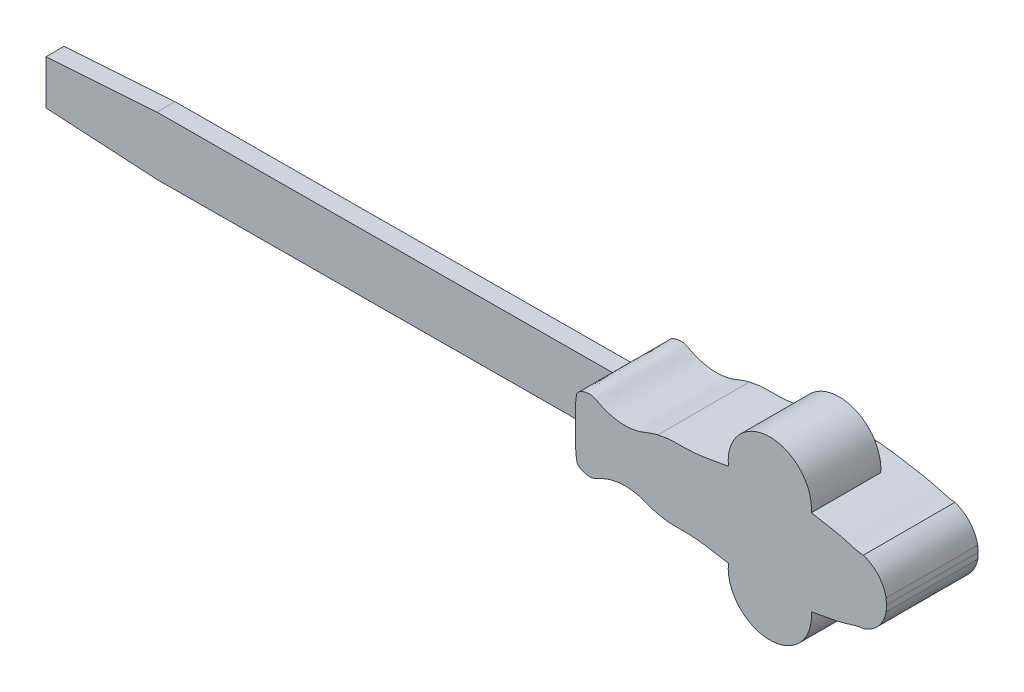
from build123d import *

# Parameters (mm, degrees)
BOSS_EXTRU_1_DEPTH      = 16.5
BOSS_EXTRU_1_DEPTH_BACK = 16.5
BOSS_EXTRU_3_DEPTH      = 25
BOSS_EXTRU_2_DEPTH      = 204
BOSS_EXTRU_2_DEPTH_BACK = 5
ESQUISSE2_W             = 6.5
ESQUISSE2_H             = 21
ENL_V_MAT_EXTRU_1_DEPTH = 208.491099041


with BuildPart() as part:
    # Esquisse1 → Boss.-Extru.1 (new, two sides: drawn at the far end of the back side and taken through both)
    with BuildSketch(Plane.XY.offset(-BOSS_EXTRU_1_DEPTH_BACK)):
        with BuildLine():
            add(Edge.make_bspline(
                [(-0.032865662, 3.401267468), (-0.224843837, 7.162553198), (0.44023693, 10.882257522)],
                knots=[0, 0, 0, 1, 1, 1], degree=2))
            add(Edge.make_bspline(
                [(0.44023693, 10.882257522), (1.254584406, 11.987068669), (3.198474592, 12.861745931), (6.069460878, 12.983670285), (8.102063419, 11.964714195), (10.410042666, 10.775554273), (13.186119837, 9.936569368), (16.542055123, 9.383749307), (20.171862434, 9.521311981), (24.057507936, 10.396311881), (27.077643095, 11.82091293), (29.045388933, 12.34115857), (29.658579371, 12.493288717)],
                knots=[0, 0, 0, 0, 0.120356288, 0.182103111, 0.252493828, 0.320379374, 0.416926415, 0.511670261, 0.625759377, 0.741661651, 0.867963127, 0.924773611, 0.924773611, 0.924773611, 0.924773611], degree=3))
            add(Edge.make_bspline(
                [(29.658579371, 12.493288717), (31.012865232, 12.750604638), (33.041458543, 13.211022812), (36.261256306, 13.256079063), (39.045258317, 13.257764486), (42.498505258, 13.390363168), (46.086926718, 13.792913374), (49.779062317, 14.488436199), (53.47784415, 15.15791922), (57.116896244, 15.727044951), (60.965789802, 16.271065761), (64.982894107, 16.626263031), (69.110135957, 17.089949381), (73.445124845, 17.062569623), (77.623582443, 16.967008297), (81.836310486, 16.32307468), (86.166989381, 15.637259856), (91.709301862, 14.738317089), (97.625170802, 13.482934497), (101.818778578, 11.944720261), (103.707407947, 11.990805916)],
                knots=[0, 0, 0, 0, 0.055398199, 0.08267741, 0.128818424, 0.167035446, 0.221096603, 0.273333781, 0.317568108, 0.371733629, 0.42094103, 0.473294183, 0.533363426, 0.587167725, 0.646878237, 0.700631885, 0.757710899, 0.822668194, 0.925588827, 1, 1, 1, 1], degree=3))
            add(Edge.make_bspline(
                [(103.707407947, 11.990805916), (105.281267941, 11.413367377), (109.12557011, 9.281811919), (111.416904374, 5.307594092), (111.901090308, 2.7335571)],
                knots=[0, 0, 0, 0, 0.390825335, 1, 1, 1, 1], degree=3))
            add(Edge.make_bspline(
                [(112, 0.541102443), (111.994702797, 1.637543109), (111.901090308, 2.7335571)],
                knots=[0.5, 0.5, 0.5, 1, 1, 1], degree=2))
            Line((112, 0.541102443), (0, 0))
            Line((0, 0), (-0.032865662, 3.401267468))
        make_face()
        with BuildLine():
            add(Edge.make_bspline(
                [(112, 0.541102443), (112.005297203, -0.555338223), (111.92227912, -1.652205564)],
                knots=[0.5, 0.5, 0.5, 1, 1, 1], degree=2))
            add(Edge.make_bspline(
                [(103.818425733, -10.988192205), (105.386632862, -10.395573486), (109.210159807, -8.226972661), (111.462986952, -4.230800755), (111.92227912, -1.652205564)],
                knots=[0, 0, 0, 0, 0.390825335, 1, 1, 1, 1], degree=3))
            add(Edge.make_bspline(
                [(29.777909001, -12.206134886), (31.13461791, -12.450353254), (33.16756523, -12.891149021), (36.387648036, -12.905092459), (39.171536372, -12.879877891), (42.625903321, -12.979104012), (46.218046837, -13.346962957), (49.916730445, -14.006778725), (53.621808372, -14.640491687), (57.266189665, -15.174429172), (61.120160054, -15.681235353), (65.140508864, -15.997601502), (69.272038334, -16.421387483), (73.606560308, -16.352122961), (77.783899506, -16.21619251), (81.990209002, -15.531584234), (86.314059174, -14.803957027), (91.847427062, -13.851504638), (97.750889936, -12.539019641), (101.929439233, -10.960357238), (103.818425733, -10.988192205)],
                knots=[0, 0, 0, 0, 0.055398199, 0.08267741, 0.128818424, 0.167035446, 0.221096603, 0.273333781, 0.317568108, 0.371733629, 0.42094103, 0.473294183, 0.533363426, 0.587167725, 0.646878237, 0.700631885, 0.757710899, 0.822668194, 0.925588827, 1, 1, 1, 1], degree=3))
            add(Edge.make_bspline(
                [(0.545364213, -10.877495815), (1.370348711, -11.974386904), (3.322599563, -12.830240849), (6.1946299, -12.924419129), (8.217292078, -11.885870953), (10.513673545, -10.674466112), (13.281514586, -9.808697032), (16.63195169, -9.223476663), (20.26291873, -9.325960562), (24.156837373, -10.163375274), (27.190596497, -11.558728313), (29.163277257, -12.059936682), (29.777909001, -12.206134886)],
                knots=[0, 0, 0, 0, 0.120356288, 0.182103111, 0.252493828, 0.320379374, 0.416926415, 0.511670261, 0.625759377, 0.741661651, 0.867963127, 0.924773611, 0.924773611, 0.924773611, 0.924773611], degree=3))
            add(Edge.make_bspline(
                [(0, -3.401426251), (-0.155626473, -7.164391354), (0.545364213, -10.877495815)],
                knots=[0, 0, 0, 1, 1, 1], degree=2))
            Line((0, -3.401426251), (0, 0))
            Line((0, 0), (112, 0.541102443))
        make_face()
    extrude(amount=BOSS_EXTRU_1_DEPTH + BOSS_EXTRU_1_DEPTH_BACK)

    # Esquisse3 → Boss.-Extru.3 (add)
    with BuildSketch(Plane.XY.offset(16.5)):
        with BuildLine():
            ThreePointArc((84.950754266, 15.828711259), (69.787759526, 32.041683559), (55.08959678, 15.406152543))
            add(Edge.make_bspline(
                [(55.08959678, 15.406152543), (55.806064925, 15.519773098), (57.737109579, 15.814708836), (60.965789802, 16.271065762), (64.982894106, 16.626263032), (69.110135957, 17.089949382), (73.445124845, 17.062569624), (77.623582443, 16.967008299), (81.49467982, 16.3752944), (83.885189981, 15.998375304), (84.950754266, 15.828711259)],
                knots=[0.342661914, 0.342661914, 0.342661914, 0.342661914, 0.371733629, 0.42094103, 0.473294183, 0.533363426, 0.587167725, 0.646878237, 0.700631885, 0.743880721, 0.743880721, 0.743880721, 0.743880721], degree=3))
        make_face()
        with BuildLine():
            ThreePointArc((55.076493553, -14.849370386), (69.907280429, -31.362013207), (84.941069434, -15.033975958))
            add(Edge.make_bspline(
                [(55.076493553, -14.849370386), (55.847054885, -14.96462114), (57.833943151, -15.249090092), (61.120160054, -15.681235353), (65.140508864, -15.997601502), (69.272038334, -16.421387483), (73.606560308, -16.352122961), (77.783899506, -16.21619251), (81.596072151, -15.595732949), (83.930053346, -15.204828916), (84.941069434, -15.033975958)],
                knots=[0.340509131, 0.340509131, 0.340509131, 0.340509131, 0.371733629, 0.42094103, 0.473294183, 0.533363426, 0.587167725, 0.646878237, 0.700631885, 0.741730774, 0.741730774, 0.741730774, 0.741730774], degree=3))
        make_face()
    extrude(amount=-BOSS_EXTRU_3_DEPTH)

    # Esquisse2 → Boss.-Extru.2 (add, two sides: drawn at the far end of the back side and taken through both)
    with BuildSketch(Plane(origin=(0, 0, 0), x_dir=(0, 0, 1), z_dir=(-0.9999883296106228, -0.004831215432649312, 0)).offset(-BOSS_EXTRU_2_DEPTH_BACK)):
        Rectangle(ESQUISSE2_W, ESQUISSE2_H)
    extrude(amount=BOSS_EXTRU_2_DEPTH + BOSS_EXTRU_2_DEPTH_BACK)

    # Esquisse4 → Enl_v. mat.-Extru.1 (cut, through all)
    with BuildSketch(Plane.XY.offset(3.25)):
        Polygon((-204.036268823, 7.014309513), (-164.048347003, 9.707560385), (-204.048347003, 9.514309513), align=None)
    enl_v_mat_extru_1 = extrude(amount=-ENL_V_MAT_EXTRU_1_DEPTH, mode=Mode.SUBTRACT)

    # Sym_trie1: Enl_v. mat.-Extru.1 across plane
    add(enl_v_mat_extru_1.mirror(Plane(origin=(0, 0, 0), x_dir=(0, 0, 1), z_dir=(-0.004831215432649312, 0.9999883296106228, 0))), mode=Mode.SUBTRACT)


solid = part.part
